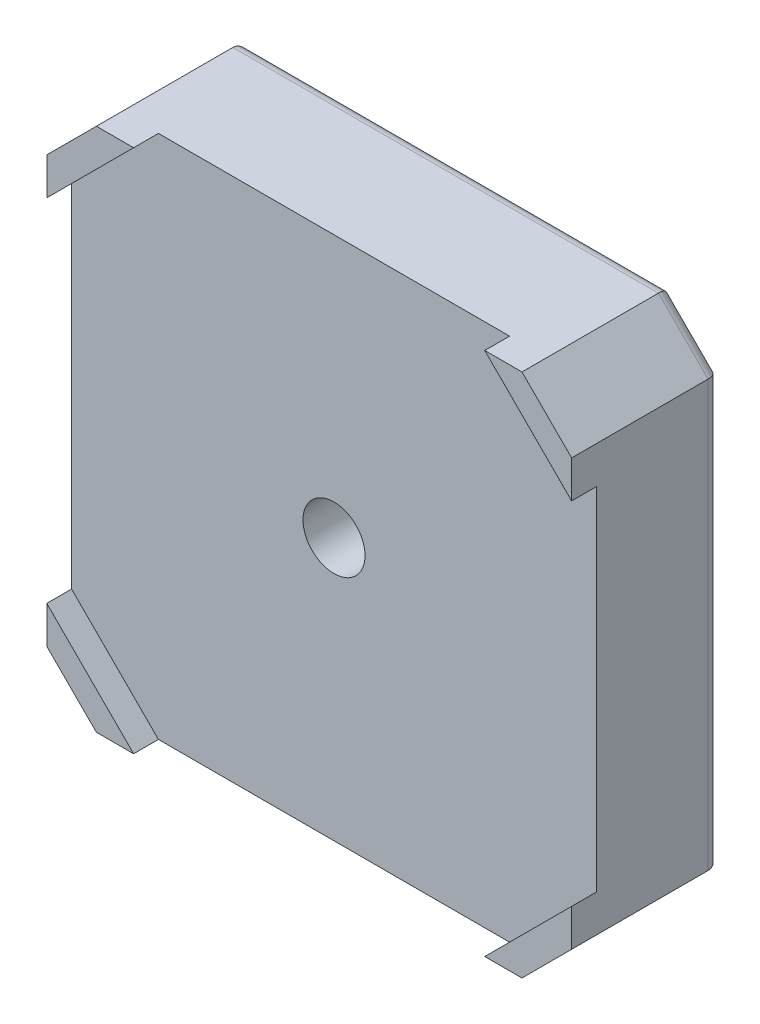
from build123d import *

# Parameters (mm, degrees)
BOSS_EXTRUDE2_DEPTH = 12
CUT_EXTRUDE1_DEPTH  = 2
SKETCH3_R           = 11
BOSS_EXTRUDE3_DEPTH = 2
SKETCH4_R           = 5.5
CUT_EXTRUDE2_DEPTH  = 7
SKETCH5_R           = 2.5
CUT_EXTRUDE3_DEPTH  = 31.718805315
FILLET1_R           = 1
FILLET2_R           = 0.5
SKETCH6_R           = 1.5
CUT_EXTRUDE4_DEPTH  = 3
FILLET3_R           = 0.5


with BuildPart() as part:
    # Sketch1 → Boss-Extrude2 (new body)
    with BuildSketch(Plane.XY):
        Polygon((-21.15, 17.15), (-17.15, 21.15), (17.15, 21.15), (21.15, 17.15), (21.15, -17.15), (17.15, -21.15), (-17.15, -21.15), (-21.15, -17.15), align=None)
    extrude(amount=BOSS_EXTRUDE2_DEPTH)

    # Sketch2 → Cut-Extrude1 (cut)
    with BuildSketch(Plane.XY.offset(12)):
        Polygon((-14.15, 21.15), (-21.15, 14.15), (-21.15, -14.15), (-14.15, -21.15), (14.15, -21.15), (21.15, -14.15), (21.15, 14.15), (14.15, 21.15), align=None)
    extrude(amount=-CUT_EXTRUDE1_DEPTH, mode=Mode.SUBTRACT)

    # Sketch3 → Boss-Extrude3 (add)
    with BuildSketch(Plane(origin=(0, 0, 0), x_dir=(-1, 0, 0), z_dir=(0, 0, -1))):
        Circle(SKETCH3_R)
    extrude(amount=BOSS_EXTRUDE3_DEPTH)

    # Sketch4 → Cut-Extrude2 (cut)
    with BuildSketch(Plane(origin=(0, 0, -2), x_dir=(-1, 0, 0), z_dir=(0, 0, -1))):
        Circle(SKETCH4_R)
    extrude(amount=-CUT_EXTRUDE2_DEPTH, mode=Mode.SUBTRACT)

    # Sketch5 → Cut-Extrude3 (cut, through all)
    with BuildSketch(Plane(origin=(0, 0, 5), x_dir=(-1, 0, 0), z_dir=(0, 0, -1))):
        Circle(SKETCH5_R)
    extrude(amount=-CUT_EXTRUDE3_DEPTH, mode=Mode.SUBTRACT)

    # Fillet1
    fillet1_edges = [part.edges().sort_by_distance(p)[0] for p in [
        (-19.15, -19.15, 0),
        (-21.15, 0, 0),
        (-19.15, 19.15, 0),
        (0, 21.15, 0),
        (19.15, 19.15, 0),
        (21.15, 0, 0),
        (19.15, -19.15, 0),
        (0, -21.15, 0),
    ]]
    fillet(fillet1_edges, radius=FILLET1_R)

    # Fillet2
    fillet2_edges = [part.edges().sort_by_distance(p)[0] for p in [
        (11, 0, -2),
        (5.5, 0, 5),
        (5.5, 0, -2),
    ]]
    fillet(fillet2_edges, radius=FILLET2_R)

    # Sketch6 → Cut-Extrude4 (cut)
    with BuildSketch(Plane(origin=(0, 0, 0), x_dir=(-1, 0, 0), z_dir=(0, 0, -1))):
        with Locations((-15.5, 15.5)):
            Circle(SKETCH6_R)
        with Locations((15.5, 15.5)):
            Circle(SKETCH6_R)
        with Locations((15.5, -15.5)):
            Circle(SKETCH6_R)
        with Locations((-15.5, -15.5)):
            Circle(SKETCH6_R)
    extrude(amount=-CUT_EXTRUDE4_DEPTH, mode=Mode.SUBTRACT)

    # Fillet3
    fillet3_edges = [part.edges().sort_by_distance(p)[0] for p in [
        (17, -15.5, 0),
        (-14, -15.5, 0),
        (-14, 15.5, 0),
        (17, 15.5, 0),
    ]]
    fillet(fillet3_edges, radius=FILLET3_R)


solid = part.part
